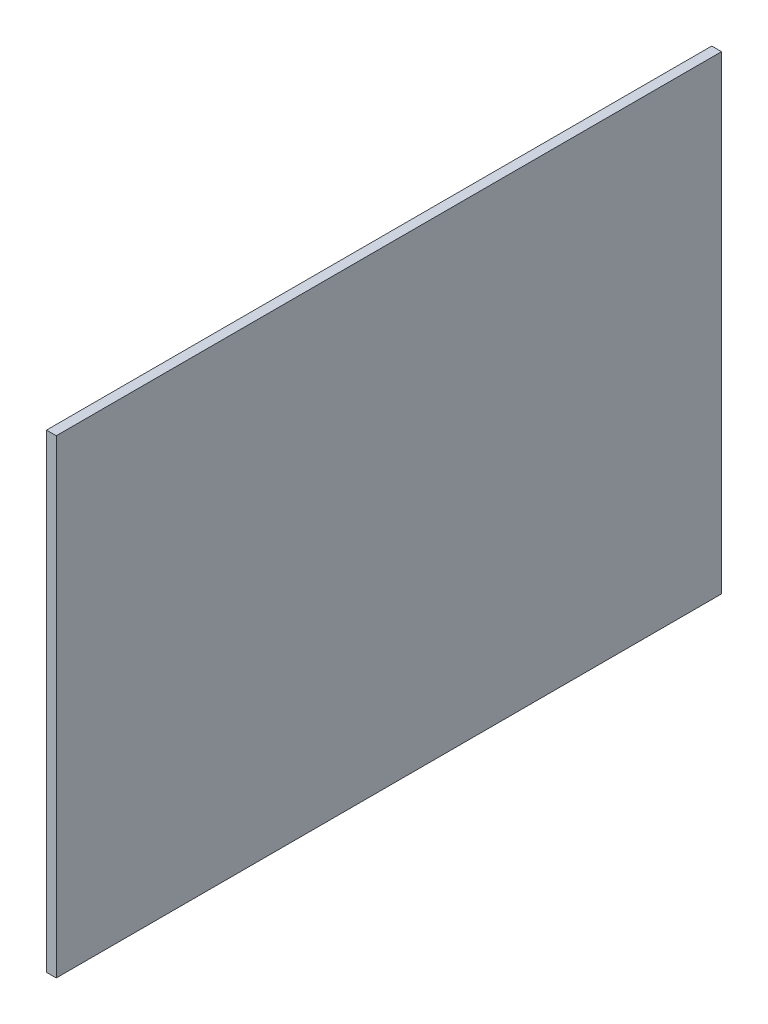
from build123d import *

# Parameters (mm, degrees)
SKETCH1_W      = 6.35
SKETCH1_H      = 304.8
EXTRUDE1_DEPTH = 215.9


with BuildPart() as part:
    # Sketch1 → Extrude1 (new, symmetric)
    with BuildSketch(Plane.XY):
        with Locations((3.175, 0)):
            Rectangle(SKETCH1_W, SKETCH1_H)
    extrude(amount=EXTRUDE1_DEPTH, both=True)


solid = part.part
